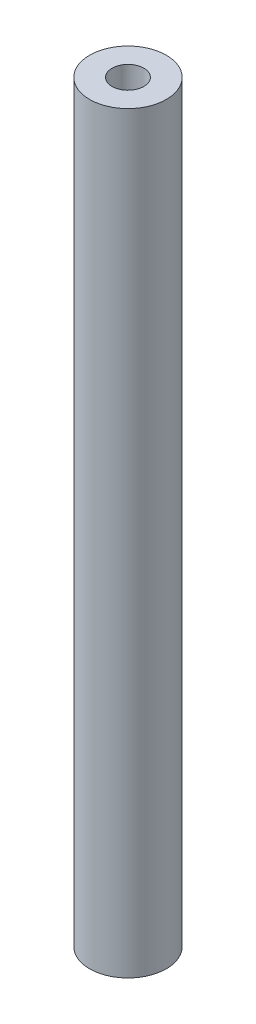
from build123d import *

# Parameters (mm, degrees)
SKETCH1_R           = 6.35
BOSS_EXTRUDE1_DEPTH = 124.661472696
SKETCH2_R           = 2.6289
CUT_EXTRUDE1_DEPTH  = 25.4
CUT_EXTRUDE2_START  = -25.4
SKETCH3_R           = 2.6289
CUT_EXTRUDE2_DEPTH  = 25.4


with BuildPart() as part:
    # Sketch1 → Boss-Extrude1 (new body)
    with BuildSketch(Plane(origin=(0, 277.550649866, 0), x_dir=(1, 0, 0), z_dir=(0, 1, 0))):
        with Locations(Location((-874.171620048, -1135.603252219, 0), (0, 0, 270))):
            Circle(SKETCH1_R)
    extrude(amount=BOSS_EXTRUDE1_DEPTH)

    # Sketch2 → Cut-Extrude1 (cut)
    with BuildSketch(Plane(origin=(0, 402.212122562, 0), x_dir=(1, 0, 0), z_dir=(0, 1, 0))):
        with Locations(Location((-874.171620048, -1135.603252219, 0), (0, 0, 270))):
            Circle(SKETCH2_R)
    extrude(amount=-CUT_EXTRUDE1_DEPTH, mode=Mode.SUBTRACT)

    # Sketch3 → Cut-Extrude2 (cut)
    with BuildSketch(Plane.XZ.offset(-277.550649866).offset(CUT_EXTRUDE2_START)):
        with Locations(Location((-874.171620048, 1135.603252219, 0), (0, 0, 90))):
            Circle(SKETCH3_R)
    extrude(amount=CUT_EXTRUDE2_DEPTH, mode=Mode.SUBTRACT)


solid = part.part
